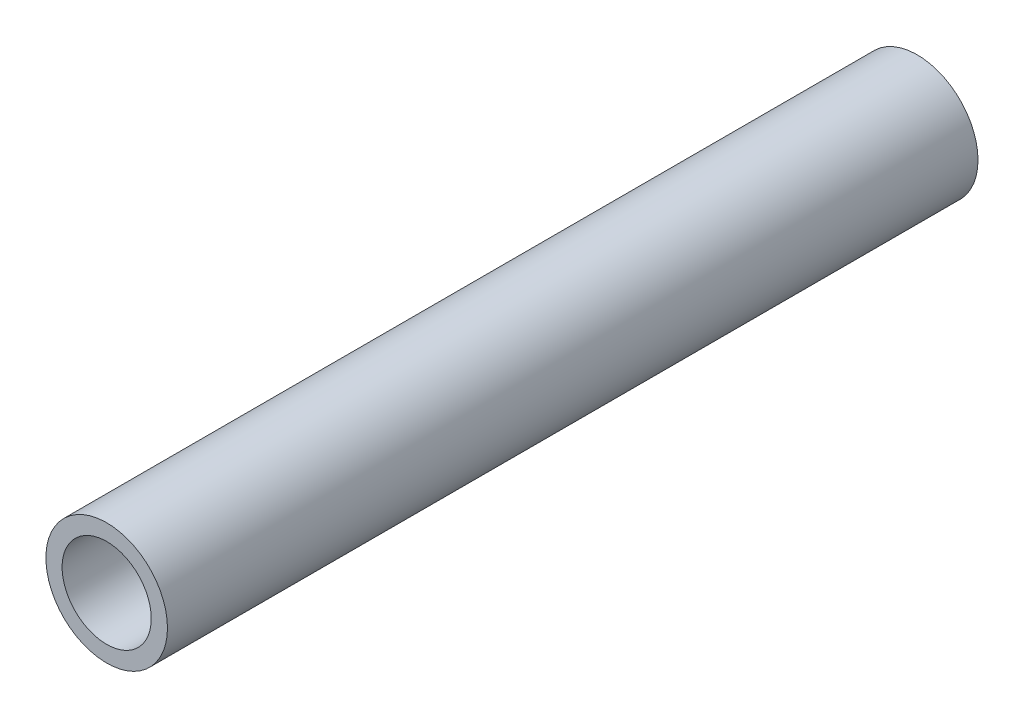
from build123d import *

# Parameters (mm, degrees)
SKETCH1_R           = 9.525
SKETCH1_R_2         = 6.985
BOSS_EXTRUDE1_DEPTH = 127


with BuildPart() as part:
    # Sketch1 → Boss-Extrude1 (new body)
    with BuildSketch(Plane.XY):
        with Locations((25.4, -101.600000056)):
            Circle(SKETCH1_R)
        with Locations((25.4, -101.600000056)):
            Circle(SKETCH1_R_2, mode=Mode.SUBTRACT)
    extrude(amount=BOSS_EXTRUDE1_DEPTH)


solid = part.part
